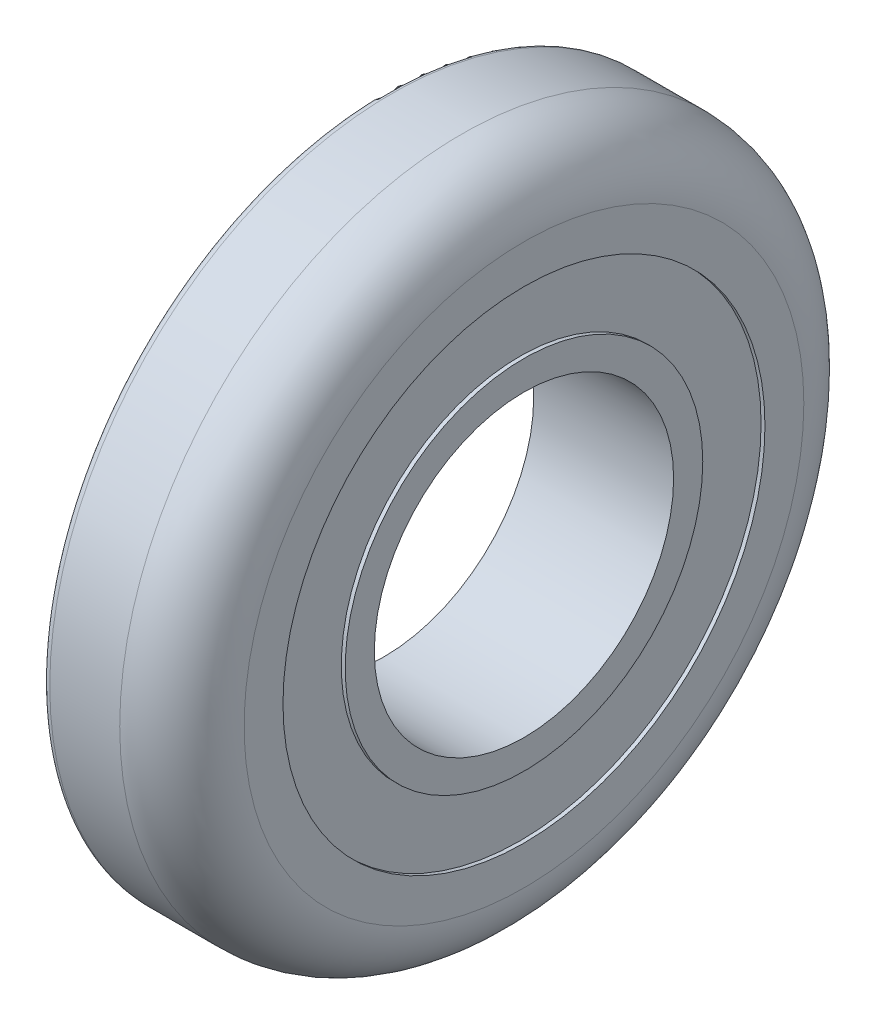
from build123d import *

# Parameters (mm, degrees)
SKETCH1_R           = 44
SKETCH1_R_2         = 19.25
BOSS_EXTRUDE1_DEPTH = 18
FILLET1_R           = 8
FILLET2_R           = 1
SKETCH2_R           = 31
SKETCH2_R_2         = 23
CUT_EXTRUDE1_DEPTH  = 0.5
CUT_EXTRUDE2_START  = -0.5
SKETCH3_R           = 31
SKETCH3_R_2         = 23
CUT_EXTRUDE2_DEPTH  = 0.5


with BuildPart() as part:
    # Sketch1 → Boss-Extrude1 (new body)
    with BuildSketch(Plane(origin=(0, 0, 0), x_dir=(0, 0, -1), z_dir=(1, 0, 0))):
        Circle(SKETCH1_R)
        Circle(SKETCH1_R_2, mode=Mode.SUBTRACT)
    extrude(amount=BOSS_EXTRUDE1_DEPTH)

    # Fillet1
    fillet1_edges = [part.edges().sort_by_distance(p)[0] for p in [
        (18, 0, 44),
    ]]
    fillet(fillet1_edges, radius=FILLET1_R)

    # Fillet2
    fillet2_edges = [part.edges().sort_by_distance(p)[0] for p in [
        (0, 0, 44),
    ]]
    fillet(fillet2_edges, radius=FILLET2_R)

    # Sketch2 → Cut-Extrude1 (cut)
    with BuildSketch(Plane(origin=(18, 0, 0), x_dir=(0, 0, -1), z_dir=(1, 0, 0))):
        Circle(SKETCH2_R)
        Circle(SKETCH2_R_2, mode=Mode.SUBTRACT)
    extrude(amount=-CUT_EXTRUDE1_DEPTH, mode=Mode.SUBTRACT)

    # Sketch3 → Cut-Extrude2 (cut)
    with BuildSketch(Plane.ZY.offset(CUT_EXTRUDE2_START)):
        with Locations(Location((0, 0, 0), (0, 0, 180))):
            Circle(SKETCH3_R)
        with Locations(Location((0, 0, 0), (0, 0, 180))):
            Circle(SKETCH3_R_2, mode=Mode.SUBTRACT)
    extrude(amount=CUT_EXTRUDE2_DEPTH, mode=Mode.SUBTRACT)


solid = part.part
